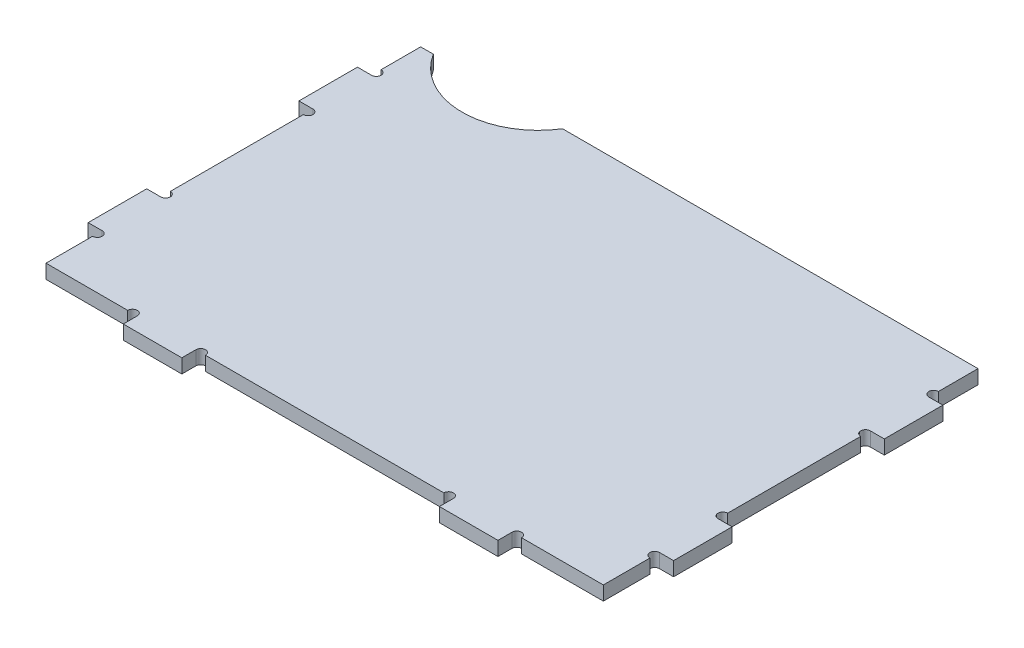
from build123d import *

# Parameters (mm, degrees)
BOSS_EXTRUDE1_DEPTH = 12


with BuildPart() as part:
    # Sketch1 → Boss-Extrude1 (new body)
    with BuildSketch(Plane(origin=(0, 0, 0), x_dir=(1, 0, 0), z_dir=(0, 1, 0))):
        with BuildLine():
            Line((-101.8, 0), (101.8, 0))
            ThreePointArc((101.8, 0), (105.9, 4.1), (110, 0))
            Line((110, 0), (110, -12))
            Line((110, -12), (160, -12))
            Line((160, -12), (160, 0))
            ThreePointArc((160, 0), (164.1, 4.1), (168.2, 0))
            Line((168.2, 0), (238, 0))
            Line((238, 0), (238, 39.8))
            ThreePointArc((238, 39.8), (233.9, 43.9), (238, 48))
            Line((238, 48), (250, 48))
            Line((250, 48), (250, 98))
            Line((250, 98), (238, 98))
            ThreePointArc((238, 98), (233.9, 102.1), (238, 106.2))
            Line((238, 106.2), (238, 219.8))
            ThreePointArc((238, 219.8), (233.9, 223.9), (238, 228))
            Line((238, 228), (250, 228))
            Line((250, 228), (250, 278))
            Line((250, 278), (238, 278))
            ThreePointArc((238, 278), (233.9, 282.1), (238, 286.2))
            Line((238, 286.2), (238, 320))
            Line((238, 320), (-116.82400522, 320))
            ThreePointArc((-116.82400522, 320), (-172, 289.36), (-227.17599478, 320))
            Line((-227.17599478, 320), (-238, 320))
            Line((-238, 320), (-238, 286.2))
            ThreePointArc((-238, 286.2), (-233.9, 282.1), (-238, 278))
            Line((-238, 278), (-250, 278))
            Line((-250, 278), (-250, 228))
            Line((-250, 228), (-238, 228))
            ThreePointArc((-238, 228), (-233.9, 223.9), (-238, 219.8))
            Line((-238, 219.8), (-238, 106.2))
            ThreePointArc((-238, 106.2), (-233.9, 102.1), (-238, 98))
            Line((-238, 98), (-250, 98))
            Line((-250, 98), (-250, 48))
            Line((-250, 48), (-238, 48))
            ThreePointArc((-238, 48), (-233.9, 43.9), (-238, 39.8))
            Line((-238, 39.8), (-238, 0))
            Line((-238, 0), (-168.2, 0))
            ThreePointArc((-168.2, 0), (-164.1, 4.1), (-160, 0))
            Line((-160, 0), (-160, -12))
            Line((-160, -12), (-110, -12))
            Line((-110, -12), (-110, 0))
            ThreePointArc((-110, 0), (-105.9, 4.1), (-101.8, 0))
        make_face()
    extrude(amount=BOSS_EXTRUDE1_DEPTH)


solid = part.part
